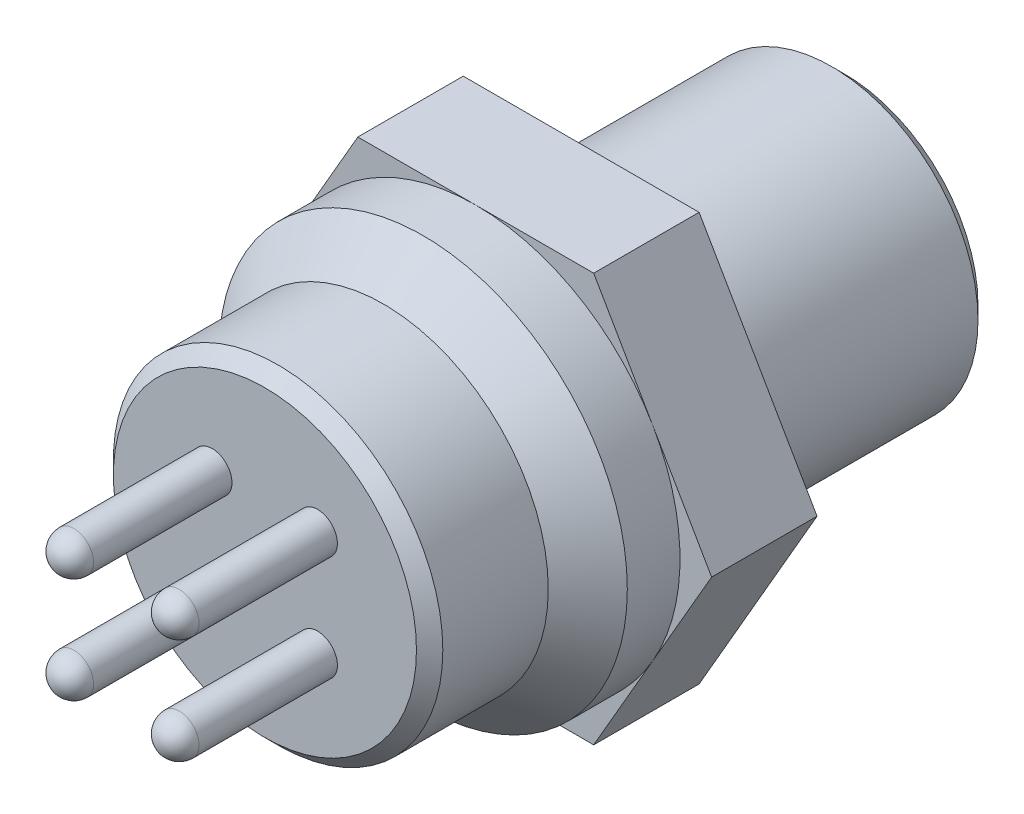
ISO-10303-21;
HEADER;
FILE_DESCRIPTION(('STEP AP214'),'2;1');
FILE_NAME('part.step','',(''),(''),'','','');
FILE_SCHEMA(('AUTOMOTIVE_DESIGN { 1 0 10303 214 1 1 1 1 }'));
ENDSEC;
DATA;
#1=APPLICATION_CONTEXT('core data for automotive mechanical design processes');
#2=APPLICATION_PROTOCOL_DEFINITION('international standard','automotive_design',2000,#1);
#3=PRODUCT_CONTEXT('',#1,'mechanical');
#4=PRODUCT('Part','Part','',(#3));
#5=PRODUCT_RELATED_PRODUCT_CATEGORY('part','',(#4));
#6=PRODUCT_DEFINITION_FORMATION('','',#4);
#7=PRODUCT_DEFINITION_CONTEXT('part definition',#1,'design');
#8=PRODUCT_DEFINITION('design','',#6,#7);
#9=PRODUCT_DEFINITION_SHAPE('','',#8);
#10=(LENGTH_UNIT() NAMED_UNIT(*) SI_UNIT(.MILLI.,.METRE.));
#11=(NAMED_UNIT(*) PLANE_ANGLE_UNIT() SI_UNIT($,.RADIAN.));
#12=(NAMED_UNIT(*) SI_UNIT($,.STERADIAN.) SOLID_ANGLE_UNIT());
#13=UNCERTAINTY_MEASURE_WITH_UNIT(LENGTH_MEASURE(1.E-05),#10,'distance_accuracy_value','');
#14=(GEOMETRIC_REPRESENTATION_CONTEXT(3) GLOBAL_UNCERTAINTY_ASSIGNED_CONTEXT((#13)) GLOBAL_UNIT_ASSIGNED_CONTEXT((#10,
#11,#12)) REPRESENTATION_CONTEXT('',''));
#15=CARTESIAN_POINT('',(0.,0.,0.));
#16=DIRECTION('',(0.,0.,1.));
#17=DIRECTION('',(1.,0.,0.));
#18=AXIS2_PLACEMENT_3D('',#15,#16,#17);
#19=CARTESIAN_POINT('',(4.4744645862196,-7.75,10.));
#20=DIRECTION('',(0.,0.,-1.));
#21=DIRECTION('',(-1.,0.,0.));
#22=AXIS2_PLACEMENT_3D('',#19,#20,#21);
#23=PLANE('',#22);
#24=DIRECTION('',(0.5,0.866025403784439,0.));
#25=VECTOR('',#24,1.);
#26=CARTESIAN_POINT('',(4.4744645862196,-7.75,10.));
#27=LINE('',#26,#25);
#28=CARTESIAN_POINT('',(4.4744645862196,-7.75,10.));
#29=VERTEX_POINT('',#28);
#30=CARTESIAN_POINT('',(8.9489291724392,0.,10.));
#31=VERTEX_POINT('',#30);
#32=EDGE_CURVE('E134',#29,#31,#27,.T.);
#33=ORIENTED_EDGE('',*,*,#32,.F.);
#34=DIRECTION('',(1.,0.,0.));
#35=VECTOR('',#34,1.);
#36=CARTESIAN_POINT('',(-4.4744645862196,-7.75,10.));
#37=LINE('',#36,#35);
#38=CARTESIAN_POINT('',(-4.4744645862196,-7.75,10.));
#39=VERTEX_POINT('',#38);
#40=EDGE_CURVE('E155',#39,#29,#37,.T.);
#41=ORIENTED_EDGE('',*,*,#40,.F.);
#42=DIRECTION('',(0.5,-0.866025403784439,0.));
#43=VECTOR('',#42,1.);
#44=CARTESIAN_POINT('',(-8.9489291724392,0.,10.));
#45=LINE('',#44,#43);
#46=CARTESIAN_POINT('',(-8.9489291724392,0.,10.));
#47=VERTEX_POINT('',#46);
#48=EDGE_CURVE('E153',#47,#39,#45,.T.);
#49=ORIENTED_EDGE('',*,*,#48,.F.);
#50=DIRECTION('',(-0.5,-0.866025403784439,0.));
#51=VECTOR('',#50,1.);
#52=CARTESIAN_POINT('',(-4.4744645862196,7.75,10.));
#53=LINE('',#52,#51);
#54=CARTESIAN_POINT('',(-4.4744645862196,7.75,10.));
#55=VERTEX_POINT('',#54);
#56=EDGE_CURVE('E151',#55,#47,#53,.T.);
#57=ORIENTED_EDGE('',*,*,#56,.F.);
#58=DIRECTION('',(-1.,0.,0.));
#59=VECTOR('',#58,1.);
#60=CARTESIAN_POINT('',(4.4744645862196,7.75,10.));
#61=LINE('',#60,#59);
#62=CARTESIAN_POINT('',(4.4744645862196,7.75,10.));
#63=VERTEX_POINT('',#62);
#64=EDGE_CURVE('E149',#63,#55,#61,.T.);
#65=ORIENTED_EDGE('',*,*,#64,.F.);
#66=DIRECTION('',(-0.5,0.866025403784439,0.));
#67=VECTOR('',#66,1.);
#68=CARTESIAN_POINT('',(8.9489291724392,0.,10.));
#69=LINE('',#68,#67);
#70=EDGE_CURVE('E147',#31,#63,#69,.T.);
#71=ORIENTED_EDGE('',*,*,#70,.F.);
#72=EDGE_LOOP('',(#33,#41,#49,#57,#65,#71));
#73=FACE_BOUND('',#72,.T.);
#74=CARTESIAN_POINT('',(0.,0.,10.));
#75=DIRECTION('',(0.,0.,1.));
#76=DIRECTION('',(0.,-1.,0.));
#77=AXIS2_PLACEMENT_3D('',#74,#75,#76);
#78=CIRCLE('',#77,7.);
#79=CARTESIAN_POINT('',(0.,-7.,10.));
#80=VERTEX_POINT('',#79);
#81=EDGE_CURVE('E290',#80,#80,#78,.T.);
#82=ORIENTED_EDGE('',*,*,#81,.T.);
#83=EDGE_LOOP('',(#82));
#84=FACE_BOUND('',#83,.T.);
#85=ADVANCED_FACE('F34',(#73,#84),#23,.T.);
#86=CARTESIAN_POINT('',(0.,0.,22.));
#87=DIRECTION('',(0.,0.,-1.));
#88=DIRECTION('',(-1.,0.,0.));
#89=AXIS2_PLACEMENT_3D('',#86,#87,#88);
#90=CYLINDRICAL_SURFACE('',#89,7.75);
#91=CARTESIAN_POINT('',(0.,0.,14.));
#92=DIRECTION('',(0.,0.,1.));
#93=DIRECTION('',(1.,0.,0.));
#94=AXIS2_PLACEMENT_3D('',#91,#92,#93);
#95=CIRCLE('',#94,7.75);
#96=CARTESIAN_POINT('',(6.7116968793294,3.875,14.));
#97=VERTEX_POINT('',#96);
#98=CARTESIAN_POINT('',(0.,7.75,14.));
#99=VERTEX_POINT('',#98);
#100=EDGE_CURVE('E129',#97,#99,#95,.T.);
#101=ORIENTED_EDGE('',*,*,#100,.T.);
#102=CARTESIAN_POINT('',(-6.7116968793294,3.875,14.));
#103=VERTEX_POINT('',#102);
#104=EDGE_CURVE('E137',#99,#103,#95,.T.);
#105=ORIENTED_EDGE('',*,*,#104,.T.);
#106=CARTESIAN_POINT('',(-6.7116968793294,-3.875,14.));
#107=VERTEX_POINT('',#106);
#108=EDGE_CURVE('E578',#103,#107,#95,.T.);
#109=ORIENTED_EDGE('',*,*,#108,.T.);
#110=CARTESIAN_POINT('',(0.,-7.75,14.));
#111=VERTEX_POINT('',#110);
#112=EDGE_CURVE('E57',#107,#111,#95,.T.);
#113=ORIENTED_EDGE('',*,*,#112,.T.);
#114=CARTESIAN_POINT('',(6.7116968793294,-3.875,14.));
#115=VERTEX_POINT('',#114);
#116=EDGE_CURVE('E49',#111,#115,#95,.T.);
#117=ORIENTED_EDGE('',*,*,#116,.T.);
#118=EDGE_CURVE('E110',#115,#97,#95,.T.);
#119=ORIENTED_EDGE('',*,*,#118,.T.);
#120=EDGE_LOOP('',(#101,#105,#109,#113,#117,#119));
#121=FACE_BOUND('',#120,.T.);
#122=CARTESIAN_POINT('',(0.,0.,16.));
#123=DIRECTION('',(0.,0.,1.));
#124=DIRECTION('',(1.,0.,0.));
#125=AXIS2_PLACEMENT_3D('',#122,#123,#124);
#126=CIRCLE('',#125,7.75);
#127=CARTESIAN_POINT('',(7.75,0.,16.));
#128=VERTEX_POINT('',#127);
#129=EDGE_CURVE('E196',#128,#128,#126,.T.);
#130=ORIENTED_EDGE('',*,*,#129,.F.);
#131=EDGE_LOOP('',(#130));
#132=FACE_BOUND('',#131,.T.);
#133=ADVANCED_FACE('F138',(#121,#132),#90,.T.);
#134=CARTESIAN_POINT('',(4.4744645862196,-7.75,14.));
#135=DIRECTION('',(0.,0.,-1.));
#136=DIRECTION('',(-1.,0.,0.));
#137=AXIS2_PLACEMENT_3D('',#134,#135,#136);
#138=PLANE('',#137);
#139=ORIENTED_EDGE('',*,*,#100,.F.);
#140=DIRECTION('',(-0.5,0.866025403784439,0.));
#141=VECTOR('',#140,1.);
#142=CARTESIAN_POINT('',(8.9489291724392,0.,14.));
#143=LINE('',#142,#141);
#144=CARTESIAN_POINT('',(4.4744645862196,7.75,14.));
#145=VERTEX_POINT('',#144);
#146=EDGE_CURVE('E117',#97,#145,#143,.T.);
#147=ORIENTED_EDGE('',*,*,#146,.T.);
#148=DIRECTION('',(-1.,0.,0.));
#149=VECTOR('',#148,1.);
#150=CARTESIAN_POINT('',(4.4744645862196,7.75,14.));
#151=LINE('',#150,#149);
#152=EDGE_CURVE('E131',#145,#99,#151,.T.);
#153=ORIENTED_EDGE('',*,*,#152,.T.);
#154=EDGE_LOOP('',(#139,#147,#153));
#155=FACE_BOUND('',#154,.T.);
#156=ADVANCED_FACE('F130',(#155),#138,.F.);
#157=ORIENTED_EDGE('',*,*,#104,.F.);
#158=CARTESIAN_POINT('',(-4.4744645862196,7.75,14.));
#159=VERTEX_POINT('',#158);
#160=EDGE_CURVE('E116',#99,#159,#151,.T.);
#161=ORIENTED_EDGE('',*,*,#160,.T.);
#162=DIRECTION('',(-0.5,-0.866025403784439,0.));
#163=VECTOR('',#162,1.);
#164=CARTESIAN_POINT('',(-4.4744645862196,7.75,14.));
#165=LINE('',#164,#163);
#166=EDGE_CURVE('E160',#159,#103,#165,.T.);
#167=ORIENTED_EDGE('',*,*,#166,.T.);
#168=EDGE_LOOP('',(#157,#161,#167));
#169=FACE_BOUND('',#168,.T.);
#170=ADVANCED_FACE('F245',(#169),#138,.F.);
#171=ORIENTED_EDGE('',*,*,#108,.F.);
#172=CARTESIAN_POINT('',(-8.9489291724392,0.,14.));
#173=VERTEX_POINT('',#172);
#174=EDGE_CURVE('E159',#103,#173,#165,.T.);
#175=ORIENTED_EDGE('',*,*,#174,.T.);
#176=DIRECTION('',(0.5,-0.866025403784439,0.));
#177=VECTOR('',#176,1.);
#178=CARTESIAN_POINT('',(-8.9489291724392,0.,14.));
#179=LINE('',#178,#177);
#180=EDGE_CURVE('E164',#173,#107,#179,.T.);
#181=ORIENTED_EDGE('',*,*,#180,.T.);
#182=EDGE_LOOP('',(#171,#175,#181));
#183=FACE_BOUND('',#182,.T.);
#184=ADVANCED_FACE('F405',(#183),#138,.F.);
#185=ORIENTED_EDGE('',*,*,#112,.F.);
#186=CARTESIAN_POINT('',(-4.4744645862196,-7.75,14.));
#187=VERTEX_POINT('',#186);
#188=EDGE_CURVE('E163',#107,#187,#179,.T.);
#189=ORIENTED_EDGE('',*,*,#188,.T.);
#190=DIRECTION('',(1.,0.,0.));
#191=VECTOR('',#190,1.);
#192=CARTESIAN_POINT('',(-4.4744645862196,-7.75,14.));
#193=LINE('',#192,#191);
#194=EDGE_CURVE('E168',#187,#111,#193,.T.);
#195=ORIENTED_EDGE('',*,*,#194,.T.);
#196=EDGE_LOOP('',(#185,#189,#195));
#197=FACE_BOUND('',#196,.T.);
#198=ADVANCED_FACE('F399',(#197),#138,.F.);
#199=ORIENTED_EDGE('',*,*,#116,.F.);
#200=CARTESIAN_POINT('',(4.4744645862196,-7.75,14.));
#201=VERTEX_POINT('',#200);
#202=EDGE_CURVE('E167',#111,#201,#193,.T.);
#203=ORIENTED_EDGE('',*,*,#202,.T.);
#204=DIRECTION('',(0.5,0.866025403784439,0.));
#205=VECTOR('',#204,1.);
#206=CARTESIAN_POINT('',(4.4744645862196,-7.75,14.));
#207=LINE('',#206,#205);
#208=EDGE_CURVE('E127',#201,#115,#207,.T.);
#209=ORIENTED_EDGE('',*,*,#208,.T.);
#210=EDGE_LOOP('',(#199,#203,#209));
#211=FACE_BOUND('',#210,.T.);
#212=ADVANCED_FACE('F393',(#211),#138,.F.);
#213=ORIENTED_EDGE('',*,*,#118,.F.);
#214=CARTESIAN_POINT('',(8.9489291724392,0.,14.));
#215=VERTEX_POINT('',#214);
#216=EDGE_CURVE('E112',#115,#215,#207,.T.);
#217=ORIENTED_EDGE('',*,*,#216,.T.);
#218=EDGE_CURVE('E106',#215,#97,#143,.T.);
#219=ORIENTED_EDGE('',*,*,#218,.T.);
#220=EDGE_LOOP('',(#213,#217,#219));
#221=FACE_BOUND('',#220,.T.);
#222=ADVANCED_FACE('F108',(#221),#138,.F.);
#223=CARTESIAN_POINT('',(4.4744645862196,-7.75,14.));
#224=DIRECTION('',(-0.866025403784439,0.5,0.));
#225=DIRECTION('',(-0.5,-0.866025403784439,0.));
#226=AXIS2_PLACEMENT_3D('',#223,#224,#225);
#227=PLANE('',#226);
#228=ORIENTED_EDGE('',*,*,#32,.T.);
#229=DIRECTION('',(0.,0.,-1.));
#230=VECTOR('',#229,1.);
#231=CARTESIAN_POINT('',(8.9489291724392,0.,14.));
#232=LINE('',#231,#230);
#233=EDGE_CURVE('E140',#215,#31,#232,.T.);
#234=ORIENTED_EDGE('',*,*,#233,.F.);
#235=ORIENTED_EDGE('',*,*,#216,.F.);
#236=ORIENTED_EDGE('',*,*,#208,.F.);
#237=DIRECTION('',(0.,0.,-1.));
#238=VECTOR('',#237,1.);
#239=CARTESIAN_POINT('',(4.4744645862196,-7.75,14.));
#240=LINE('',#239,#238);
#241=EDGE_CURVE('E170',#201,#29,#240,.T.);
#242=ORIENTED_EDGE('',*,*,#241,.T.);
#243=EDGE_LOOP('',(#228,#234,#235,#236,#242));
#244=FACE_BOUND('',#243,.T.);
#245=ADVANCED_FACE('F265',(#244),#227,.F.);
#246=CARTESIAN_POINT('',(8.9489291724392,0.,14.));
#247=DIRECTION('',(-0.866025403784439,-0.5,0.));
#248=DIRECTION('',(0.5,-0.866025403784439,0.));
#249=AXIS2_PLACEMENT_3D('',#246,#247,#248);
#250=PLANE('',#249);
#251=ORIENTED_EDGE('',*,*,#70,.T.);
#252=DIRECTION('',(0.,0.,-1.));
#253=VECTOR('',#252,1.);
#254=CARTESIAN_POINT('',(4.4744645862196,7.75,14.));
#255=LINE('',#254,#253);
#256=EDGE_CURVE('E123',#145,#63,#255,.T.);
#257=ORIENTED_EDGE('',*,*,#256,.F.);
#258=ORIENTED_EDGE('',*,*,#146,.F.);
#259=ORIENTED_EDGE('',*,*,#218,.F.);
#260=ORIENTED_EDGE('',*,*,#233,.T.);
#261=EDGE_LOOP('',(#251,#257,#258,#259,#260));
#262=FACE_BOUND('',#261,.T.);
#263=ADVANCED_FACE('F121',(#262),#250,.F.);
#264=CARTESIAN_POINT('',(4.4744645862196,7.75,14.));
#265=DIRECTION('',(0.,-1.,0.));
#266=DIRECTION('',(1.,0.,0.));
#267=AXIS2_PLACEMENT_3D('',#264,#265,#266);
#268=PLANE('',#267);
#269=ORIENTED_EDGE('',*,*,#64,.T.);
#270=DIRECTION('',(0.,0.,-1.));
#271=VECTOR('',#270,1.);
#272=CARTESIAN_POINT('',(-4.4744645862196,7.75,14.));
#273=LINE('',#272,#271);
#274=EDGE_CURVE('E179',#159,#55,#273,.T.);
#275=ORIENTED_EDGE('',*,*,#274,.F.);
#276=ORIENTED_EDGE('',*,*,#160,.F.);
#277=ORIENTED_EDGE('',*,*,#152,.F.);
#278=ORIENTED_EDGE('',*,*,#256,.T.);
#279=EDGE_LOOP('',(#269,#275,#276,#277,#278));
#280=FACE_BOUND('',#279,.T.);
#281=ADVANCED_FACE('F258',(#280),#268,.F.);
#282=CARTESIAN_POINT('',(-4.4744645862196,7.75,14.));
#283=DIRECTION('',(0.866025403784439,-0.5,0.));
#284=DIRECTION('',(0.5,0.866025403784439,0.));
#285=AXIS2_PLACEMENT_3D('',#282,#283,#284);
#286=PLANE('',#285);
#287=ORIENTED_EDGE('',*,*,#56,.T.);
#288=DIRECTION('',(0.,0.,-1.));
#289=VECTOR('',#288,1.);
#290=CARTESIAN_POINT('',(-8.9489291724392,0.,14.));
#291=LINE('',#290,#289);
#292=EDGE_CURVE('E176',#173,#47,#291,.T.);
#293=ORIENTED_EDGE('',*,*,#292,.F.);
#294=ORIENTED_EDGE('',*,*,#174,.F.);
#295=ORIENTED_EDGE('',*,*,#166,.F.);
#296=ORIENTED_EDGE('',*,*,#274,.T.);
#297=EDGE_LOOP('',(#287,#293,#294,#295,#296));
#298=FACE_BOUND('',#297,.T.);
#299=ADVANCED_FACE('F254',(#298),#286,.F.);
#300=CARTESIAN_POINT('',(-8.9489291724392,0.,14.));
#301=DIRECTION('',(0.866025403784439,0.5,0.));
#302=DIRECTION('',(-0.5,0.866025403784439,0.));
#303=AXIS2_PLACEMENT_3D('',#300,#301,#302);
#304=PLANE('',#303);
#305=ORIENTED_EDGE('',*,*,#48,.T.);
#306=DIRECTION('',(0.,0.,-1.));
#307=VECTOR('',#306,1.);
#308=CARTESIAN_POINT('',(-4.4744645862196,-7.75,14.));
#309=LINE('',#308,#307);
#310=EDGE_CURVE('E173',#187,#39,#309,.T.);
#311=ORIENTED_EDGE('',*,*,#310,.F.);
#312=ORIENTED_EDGE('',*,*,#188,.F.);
#313=ORIENTED_EDGE('',*,*,#180,.F.);
#314=ORIENTED_EDGE('',*,*,#292,.T.);
#315=EDGE_LOOP('',(#305,#311,#312,#313,#314));
#316=FACE_BOUND('',#315,.T.);
#317=ADVANCED_FACE('F250',(#316),#304,.F.);
#318=CARTESIAN_POINT('',(-4.4744645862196,-7.75,14.));
#319=DIRECTION('',(0.,1.,0.));
#320=DIRECTION('',(-1.,0.,0.));
#321=AXIS2_PLACEMENT_3D('',#318,#319,#320);
#322=PLANE('',#321);
#323=ORIENTED_EDGE('',*,*,#40,.T.);
#324=ORIENTED_EDGE('',*,*,#241,.F.);
#325=ORIENTED_EDGE('',*,*,#202,.F.);
#326=ORIENTED_EDGE('',*,*,#194,.F.);
#327=ORIENTED_EDGE('',*,*,#310,.T.);
#328=EDGE_LOOP('',(#323,#324,#325,#326,#327));
#329=FACE_BOUND('',#328,.T.);
#330=ADVANCED_FACE('F246',(#329),#322,.F.);
#331=CARTESIAN_POINT('',(0.,0.,16.));
#332=DIRECTION('',(0.,0.,1.));
#333=DIRECTION('',(1.,0.,0.));
#334=AXIS2_PLACEMENT_3D('',#331,#332,#333);
#335=CYLINDRICAL_SURFACE('',#334,6.25);
#336=CARTESIAN_POINT('',(0.,0.,21.5));
#337=DIRECTION('',(0.,0.,1.));
#338=DIRECTION('',(1.,0.,0.));
#339=AXIS2_PLACEMENT_3D('',#336,#337,#338);
#340=CIRCLE('',#339,6.25);
#341=CARTESIAN_POINT('',(6.25,0.,21.5));
#342=VERTEX_POINT('',#341);
#343=EDGE_CURVE('E11',#342,#342,#340,.F.);
#344=ORIENTED_EDGE('',*,*,#343,.T.);
#345=EDGE_LOOP('',(#344));
#346=FACE_BOUND('',#345,.T.);
#347=CARTESIAN_POINT('',(0.,0.,17.5));
#348=DIRECTION('',(0.,0.,1.));
#349=DIRECTION('',(1.,0.,0.));
#350=AXIS2_PLACEMENT_3D('',#347,#348,#349);
#351=CIRCLE('',#350,6.25);
#352=CARTESIAN_POINT('',(6.25,0.,17.5));
#353=VERTEX_POINT('',#352);
#354=EDGE_CURVE('E195',#353,#353,#351,.T.);
#355=ORIENTED_EDGE('',*,*,#354,.T.);
#356=EDGE_LOOP('',(#355));
#357=FACE_BOUND('',#356,.T.);
#358=ADVANCED_FACE('F249',(#346,#357),#335,.T.);
#359=CARTESIAN_POINT('',(-2.,-2.,27.25));
#360=DIRECTION('',(0.,0.,1.));
#361=DIRECTION('',(1.,0.,0.));
#362=AXIS2_PLACEMENT_3D('',#359,#360,#361);
#363=SPHERICAL_SURFACE('',#362,0.75);
#364=CARTESIAN_POINT('',(-2.,-2.,27.25));
#365=DIRECTION('',(0.,0.,-1.));
#366=DIRECTION('',(-1.,0.,0.));
#367=AXIS2_PLACEMENT_3D('',#364,#365,#366);
#368=CIRCLE('',#367,0.75);
#369=CARTESIAN_POINT('',(-2.75,-2.,27.25));
#370=VERTEX_POINT('',#369);
#371=EDGE_CURVE('E183',#370,#370,#368,.T.);
#372=ORIENTED_EDGE('',*,*,#371,.F.);
#373=EDGE_LOOP('',(#372));
#374=FACE_BOUND('',#373,.T.);
#375=ADVANCED_FACE('F347',(#374),#363,.T.);
#376=CARTESIAN_POINT('',(-2.,2.,27.25));
#377=DIRECTION('',(0.,0.,1.));
#378=DIRECTION('',(1.,0.,0.));
#379=AXIS2_PLACEMENT_3D('',#376,#377,#378);
#380=SPHERICAL_SURFACE('',#379,0.75);
#381=CARTESIAN_POINT('',(-2.,2.,27.25));
#382=DIRECTION('',(0.,0.,-1.));
#383=DIRECTION('',(-1.,0.,0.));
#384=AXIS2_PLACEMENT_3D('',#381,#382,#383);
#385=CIRCLE('',#384,0.75);
#386=CARTESIAN_POINT('',(-2.75,2.,27.25));
#387=VERTEX_POINT('',#386);
#388=EDGE_CURVE('E186',#387,#387,#385,.T.);
#389=ORIENTED_EDGE('',*,*,#388,.F.);
#390=EDGE_LOOP('',(#389));
#391=FACE_BOUND('',#390,.T.);
#392=ADVANCED_FACE('F342',(#391),#380,.T.);
#393=CARTESIAN_POINT('',(2.,2.,27.25));
#394=DIRECTION('',(0.,0.,1.));
#395=DIRECTION('',(1.,0.,0.));
#396=AXIS2_PLACEMENT_3D('',#393,#394,#395);
#397=SPHERICAL_SURFACE('',#396,0.75);
#398=CARTESIAN_POINT('',(2.,2.,27.25));
#399=DIRECTION('',(0.,0.,-1.));
#400=DIRECTION('',(-1.,0.,0.));
#401=AXIS2_PLACEMENT_3D('',#398,#399,#400);
#402=CIRCLE('',#401,0.75);
#403=CARTESIAN_POINT('',(1.25,2.,27.25));
#404=VERTEX_POINT('',#403);
#405=EDGE_CURVE('E189',#404,#404,#402,.T.);
#406=ORIENTED_EDGE('',*,*,#405,.F.);
#407=EDGE_LOOP('',(#406));
#408=FACE_BOUND('',#407,.T.);
#409=ADVANCED_FACE('F327',(#408),#397,.T.);
#410=CARTESIAN_POINT('',(2.,-2.,27.25));
#411=DIRECTION('',(0.,0.,1.));
#412=DIRECTION('',(1.,0.,0.));
#413=AXIS2_PLACEMENT_3D('',#410,#411,#412);
#414=SPHERICAL_SURFACE('',#413,0.75);
#415=CARTESIAN_POINT('',(2.,-2.,27.25));
#416=DIRECTION('',(0.,0.,-1.));
#417=DIRECTION('',(-1.,0.,0.));
#418=AXIS2_PLACEMENT_3D('',#415,#416,#417);
#419=CIRCLE('',#418,0.75);
#420=CARTESIAN_POINT('',(1.25,-2.,27.25));
#421=VERTEX_POINT('',#420);
#422=EDGE_CURVE('E192',#421,#421,#419,.T.);
#423=ORIENTED_EDGE('',*,*,#422,.F.);
#424=EDGE_LOOP('',(#423));
#425=FACE_BOUND('',#424,.T.);
#426=ADVANCED_FACE('F317',(#425),#414,.T.);
#427=CARTESIAN_POINT('',(-2.,-2.,28.));
#428=DIRECTION('',(0.,0.,-1.));
#429=DIRECTION('',(-1.,0.,0.));
#430=AXIS2_PLACEMENT_3D('',#427,#428,#429);
#431=CYLINDRICAL_SURFACE('',#430,0.75);
#432=ORIENTED_EDGE('',*,*,#371,.T.);
#433=EDGE_LOOP('',(#432));
#434=FACE_BOUND('',#433,.T.);
#435=CARTESIAN_POINT('',(-2.,-2.,22.));
#436=DIRECTION('',(0.,0.,1.));
#437=DIRECTION('',(-1.,0.,0.));
#438=AXIS2_PLACEMENT_3D('',#435,#436,#437);
#439=CIRCLE('',#438,0.75);
#440=CARTESIAN_POINT('',(-2.75,-2.,22.));
#441=VERTEX_POINT('',#440);
#442=EDGE_CURVE('E299',#441,#441,#439,.T.);
#443=ORIENTED_EDGE('',*,*,#442,.T.);
#444=EDGE_LOOP('',(#443));
#445=FACE_BOUND('',#444,.T.);
#446=ADVANCED_FACE('F315',(#434,#445),#431,.T.);
#447=CARTESIAN_POINT('',(-2.,2.,28.));
#448=DIRECTION('',(0.,0.,-1.));
#449=DIRECTION('',(-1.,0.,0.));
#450=AXIS2_PLACEMENT_3D('',#447,#448,#449);
#451=CYLINDRICAL_SURFACE('',#450,0.75);
#452=ORIENTED_EDGE('',*,*,#388,.T.);
#453=EDGE_LOOP('',(#452));
#454=FACE_BOUND('',#453,.T.);
#455=CARTESIAN_POINT('',(-2.,2.,22.));
#456=DIRECTION('',(0.,0.,1.));
#457=DIRECTION('',(1.,0.,0.));
#458=AXIS2_PLACEMENT_3D('',#455,#456,#457);
#459=CIRCLE('',#458,0.75);
#460=CARTESIAN_POINT('',(-1.25,2.,22.));
#461=VERTEX_POINT('',#460);
#462=EDGE_CURVE('E135',#461,#461,#459,.T.);
#463=ORIENTED_EDGE('',*,*,#462,.T.);
#464=EDGE_LOOP('',(#463));
#465=FACE_BOUND('',#464,.T.);
#466=ADVANCED_FACE('F308',(#454,#465),#451,.T.);
#467=CARTESIAN_POINT('',(2.,2.,28.));
#468=DIRECTION('',(0.,0.,-1.));
#469=DIRECTION('',(-1.,0.,0.));
#470=AXIS2_PLACEMENT_3D('',#467,#468,#469);
#471=CYLINDRICAL_SURFACE('',#470,0.75);
#472=ORIENTED_EDGE('',*,*,#405,.T.);
#473=EDGE_LOOP('',(#472));
#474=FACE_BOUND('',#473,.T.);
#475=CARTESIAN_POINT('',(2.,2.,22.));
#476=DIRECTION('',(0.,0.,1.));
#477=DIRECTION('',(-1.,0.,0.));
#478=AXIS2_PLACEMENT_3D('',#475,#476,#477);
#479=CIRCLE('',#478,0.75);
#480=CARTESIAN_POINT('',(1.25,2.,22.));
#481=VERTEX_POINT('',#480);
#482=EDGE_CURVE('E301',#481,#481,#479,.T.);
#483=ORIENTED_EDGE('',*,*,#482,.T.);
#484=EDGE_LOOP('',(#483));
#485=FACE_BOUND('',#484,.T.);
#486=ADVANCED_FACE('F324',(#474,#485),#471,.T.);
#487=CARTESIAN_POINT('',(2.,-2.,28.));
#488=DIRECTION('',(0.,0.,-1.));
#489=DIRECTION('',(-1.,0.,0.));
#490=AXIS2_PLACEMENT_3D('',#487,#488,#489);
#491=CYLINDRICAL_SURFACE('',#490,0.75);
#492=ORIENTED_EDGE('',*,*,#422,.T.);
#493=EDGE_LOOP('',(#492));
#494=FACE_BOUND('',#493,.T.);
#495=CARTESIAN_POINT('',(2.,-2.,22.));
#496=DIRECTION('',(0.,0.,1.));
#497=DIRECTION('',(1.,0.,0.));
#498=AXIS2_PLACEMENT_3D('',#495,#496,#497);
#499=CIRCLE('',#498,0.75);
#500=CARTESIAN_POINT('',(2.75,-2.,22.));
#501=VERTEX_POINT('',#500);
#502=EDGE_CURVE('E199',#501,#501,#499,.T.);
#503=ORIENTED_EDGE('',*,*,#502,.T.);
#504=EDGE_LOOP('',(#503));
#505=FACE_BOUND('',#504,.T.);
#506=ADVANCED_FACE('F312',(#494,#505),#491,.T.);
#507=CARTESIAN_POINT('',(0.,0.,22.));
#508=DIRECTION('',(0.,0.,1.));
#509=DIRECTION('',(1.,0.,0.));
#510=AXIS2_PLACEMENT_3D('',#507,#508,#509);
#511=PLANE('',#510);
#512=CARTESIAN_POINT('',(0.,0.,22.));
#513=DIRECTION('',(0.,0.,1.));
#514=DIRECTION('',(1.,0.,0.));
#515=AXIS2_PLACEMENT_3D('',#512,#513,#514);
#516=CIRCLE('',#515,5.75);
#517=CARTESIAN_POINT('',(5.75,0.,22.));
#518=VERTEX_POINT('',#517);
#519=EDGE_CURVE('E42',#518,#518,#516,.T.);
#520=ORIENTED_EDGE('',*,*,#519,.T.);
#521=EDGE_LOOP('',(#520));
#522=FACE_BOUND('',#521,.T.);
#523=ORIENTED_EDGE('',*,*,#502,.F.);
#524=EDGE_LOOP('',(#523));
#525=FACE_BOUND('',#524,.T.);
#526=ORIENTED_EDGE('',*,*,#482,.F.);
#527=EDGE_LOOP('',(#526));
#528=FACE_BOUND('',#527,.T.);
#529=ORIENTED_EDGE('',*,*,#462,.F.);
#530=EDGE_LOOP('',(#529));
#531=FACE_BOUND('',#530,.T.);
#532=ORIENTED_EDGE('',*,*,#442,.F.);
#533=EDGE_LOOP('',(#532));
#534=FACE_BOUND('',#533,.T.);
#535=ADVANCED_FACE('F211',(#522,#525,#528,#531,#534),#511,.T.);
#536=CARTESIAN_POINT('',(0.,0.,17.5));
#537=DIRECTION('',(0.,0.,-1.));
#538=DIRECTION('',(-1.,0.,0.));
#539=AXIS2_PLACEMENT_3D('',#536,#537,#538);
#540=CONICAL_SURFACE('',#539,6.25,0.785398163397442);
#541=ORIENTED_EDGE('',*,*,#129,.T.);
#542=EDGE_LOOP('',(#541));
#543=FACE_BOUND('',#542,.T.);
#544=ORIENTED_EDGE('',*,*,#354,.F.);
#545=EDGE_LOOP('',(#544));
#546=FACE_BOUND('',#545,.T.);
#547=ADVANCED_FACE('F217',(#543,#546),#540,.T.);
#548=CARTESIAN_POINT('',(0.,0.,22.));
#549=DIRECTION('',(0.,0.,-1.));
#550=DIRECTION('',(-1.,0.,0.));
#551=AXIS2_PLACEMENT_3D('',#548,#549,#550);
#552=CONICAL_SURFACE('',#551,5.75,0.785398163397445);
#553=ORIENTED_EDGE('',*,*,#343,.F.);
#554=EDGE_LOOP('',(#553));
#555=FACE_BOUND('',#554,.T.);
#556=ORIENTED_EDGE('',*,*,#519,.F.);
#557=EDGE_LOOP('',(#556));
#558=FACE_BOUND('',#557,.T.);
#559=ADVANCED_FACE('F214',(#555,#558),#552,.T.);
#560=CARTESIAN_POINT('',(-7.,0.,10.));
#561=DIRECTION('',(0.,0.,1.));
#562=DIRECTION('',(0.,-1.,0.));
#563=AXIS2_PLACEMENT_3D('',#560,#561,#562);
#564=PLANE('',#563);
#565=CARTESIAN_POINT('',(0.,0.,10.));
#566=DIRECTION('',(0.,0.,1.));
#567=DIRECTION('',(0.,-1.,0.));
#568=AXIS2_PLACEMENT_3D('',#565,#566,#567);
#569=CIRCLE('',#568,5.5);
#570=CARTESIAN_POINT('',(0.,-5.5,10.));
#571=VERTEX_POINT('',#570);
#572=EDGE_CURVE('E293',#571,#571,#569,.T.);
#573=ORIENTED_EDGE('',*,*,#572,.F.);
#574=EDGE_LOOP('',(#573));
#575=FACE_BOUND('',#574,.T.);
#576=CARTESIAN_POINT('',(0.,0.,10.));
#577=DIRECTION('',(0.,0.,1.));
#578=DIRECTION('',(0.,-1.,0.));
#579=AXIS2_PLACEMENT_3D('',#576,#577,#578);
#580=CIRCLE('',#579,5.55625);
#581=CARTESIAN_POINT('',(0.,-5.55625,10.));
#582=VERTEX_POINT('',#581);
#583=EDGE_CURVE('E200',#582,#582,#580,.T.);
#584=ORIENTED_EDGE('',*,*,#583,.T.);
#585=EDGE_LOOP('',(#584));
#586=FACE_BOUND('',#585,.T.);
#587=ADVANCED_FACE('F216',(#575,#586),#564,.T.);
#588=CARTESIAN_POINT('',(0.,0.,10.));
#589=DIRECTION('',(0.,0.,1.));
#590=DIRECTION('',(0.,-1.,0.));
#591=AXIS2_PLACEMENT_3D('',#588,#589,#590);
#592=CYLINDRICAL_SURFACE('',#591,7.);
#593=CARTESIAN_POINT('',(0.,0.,11.5));
#594=DIRECTION('',(0.,0.,1.));
#595=DIRECTION('',(0.,-1.,0.));
#596=AXIS2_PLACEMENT_3D('',#593,#594,#595);
#597=CIRCLE('',#596,7.);
#598=CARTESIAN_POINT('',(0.,-7.,11.5));
#599=VERTEX_POINT('',#598);
#600=EDGE_CURVE('E566',#599,#599,#597,.T.);
#601=ORIENTED_EDGE('',*,*,#600,.T.);
#602=EDGE_LOOP('',(#601));
#603=FACE_BOUND('',#602,.T.);
#604=ORIENTED_EDGE('',*,*,#81,.F.);
#605=EDGE_LOOP('',(#604));
#606=FACE_BOUND('',#605,.T.);
#607=ADVANCED_FACE('F224',(#603,#606),#592,.F.);
#608=CARTESIAN_POINT('',(0.,0.,10.));
#609=DIRECTION('',(0.,0.,1.));
#610=DIRECTION('',(0.,-1.,0.));
#611=AXIS2_PLACEMENT_3D('',#608,#609,#610);
#612=CYLINDRICAL_SURFACE('',#611,5.5);
#613=ORIENTED_EDGE('',*,*,#572,.T.);
#614=EDGE_LOOP('',(#613));
#615=FACE_BOUND('',#614,.T.);
#616=CARTESIAN_POINT('',(0.,0.,11.5));
#617=DIRECTION('',(0.,0.,1.));
#618=DIRECTION('',(0.,-1.,0.));
#619=AXIS2_PLACEMENT_3D('',#616,#617,#618);
#620=CIRCLE('',#619,5.5);
#621=CARTESIAN_POINT('',(0.,-5.5,11.5));
#622=VERTEX_POINT('',#621);
#623=EDGE_CURVE('E565',#622,#622,#620,.T.);
#624=ORIENTED_EDGE('',*,*,#623,.F.);
#625=EDGE_LOOP('',(#624));
#626=FACE_BOUND('',#625,.T.);
#627=ADVANCED_FACE('F278',(#615,#626),#612,.T.);
#628=CARTESIAN_POINT('',(-7.,0.,11.5));
#629=DIRECTION('',(0.,0.,-1.));
#630=DIRECTION('',(0.,1.,0.));
#631=AXIS2_PLACEMENT_3D('',#628,#629,#630);
#632=PLANE('',#631);
#633=ORIENTED_EDGE('',*,*,#623,.T.);
#634=EDGE_LOOP('',(#633));
#635=FACE_BOUND('',#634,.T.);
#636=ORIENTED_EDGE('',*,*,#600,.F.);
#637=EDGE_LOOP('',(#636));
#638=FACE_BOUND('',#637,.T.);
#639=ADVANCED_FACE('F271',(#635,#638),#632,.T.);
#640=CARTESIAN_POINT('',(0.,0.,0.));
#641=DIRECTION('',(0.,0.,1.));
#642=DIRECTION('',(1.,0.,0.));
#643=AXIS2_PLACEMENT_3D('',#640,#641,#642);
#644=PLANE('',#643);
#645=CARTESIAN_POINT('',(0.,0.,0.));
#646=DIRECTION('',(0.,0.,1.));
#647=DIRECTION('',(1.,0.,0.));
#648=AXIS2_PLACEMENT_3D('',#645,#646,#647);
#649=CIRCLE('',#648,5.05625);
#650=CARTESIAN_POINT('',(5.05625,0.,0.));
#651=VERTEX_POINT('',#650);
#652=EDGE_CURVE('E206',#651,#651,#649,.F.);
#653=ORIENTED_EDGE('',*,*,#652,.T.);
#654=EDGE_LOOP('',(#653));
#655=FACE_BOUND('',#654,.T.);
#656=ADVANCED_FACE('F268',(#655),#644,.F.);
#657=CARTESIAN_POINT('',(0.,0.,0.5));
#658=DIRECTION('',(0.,0.,1.));
#659=DIRECTION('',(1.,0.,0.));
#660=AXIS2_PLACEMENT_3D('',#657,#658,#659);
#661=CONICAL_SURFACE('',#660,5.55625,0.78539816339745);
#662=ORIENTED_EDGE('',*,*,#652,.F.);
#663=EDGE_LOOP('',(#662));
#664=FACE_BOUND('',#663,.T.);
#665=CARTESIAN_POINT('',(0.,0.,0.5));
#666=DIRECTION('',(0.,0.,1.));
#667=DIRECTION('',(1.,0.,0.));
#668=AXIS2_PLACEMENT_3D('',#665,#666,#667);
#669=CIRCLE('',#668,5.55625);
#670=CARTESIAN_POINT('',(5.55625,0.,0.5));
#671=VERTEX_POINT('',#670);
#672=EDGE_CURVE('E203',#671,#671,#669,.T.);
#673=ORIENTED_EDGE('',*,*,#672,.F.);
#674=EDGE_LOOP('',(#673));
#675=FACE_BOUND('',#674,.T.);
#676=ADVANCED_FACE('F270',(#664,#675),#661,.T.);
#677=CARTESIAN_POINT('',(0.,0.,10.));
#678=DIRECTION('',(0.,0.,-1.));
#679=DIRECTION('',(-1.,0.,0.));
#680=AXIS2_PLACEMENT_3D('',#677,#678,#679);
#681=CYLINDRICAL_SURFACE('',#680,5.55625);
#682=ORIENTED_EDGE('',*,*,#672,.T.);
#683=EDGE_LOOP('',(#682));
#684=FACE_BOUND('',#683,.T.);
#685=ORIENTED_EDGE('',*,*,#583,.F.);
#686=EDGE_LOOP('',(#685));
#687=FACE_BOUND('',#686,.T.);
#688=ADVANCED_FACE('F36',(#684,#687),#681,.T.);
#689=CLOSED_SHELL('',(#85,#133,#156,#170,#184,#198,#212,#222,#245,#263,#281,#299,#317,#330,#358,
#375,#392,#409,#426,#446,#466,#486,#506,#535,#547,#559,#587,#607,#627,#639,#656,#676,#688));
#690=MANIFOLD_SOLID_BREP('B2',#689);
#691=ADVANCED_BREP_SHAPE_REPRESENTATION('',(#18,#690),#14);
#692=SHAPE_DEFINITION_REPRESENTATION(#9,#691);
ENDSEC;
END-ISO-10303-21;
